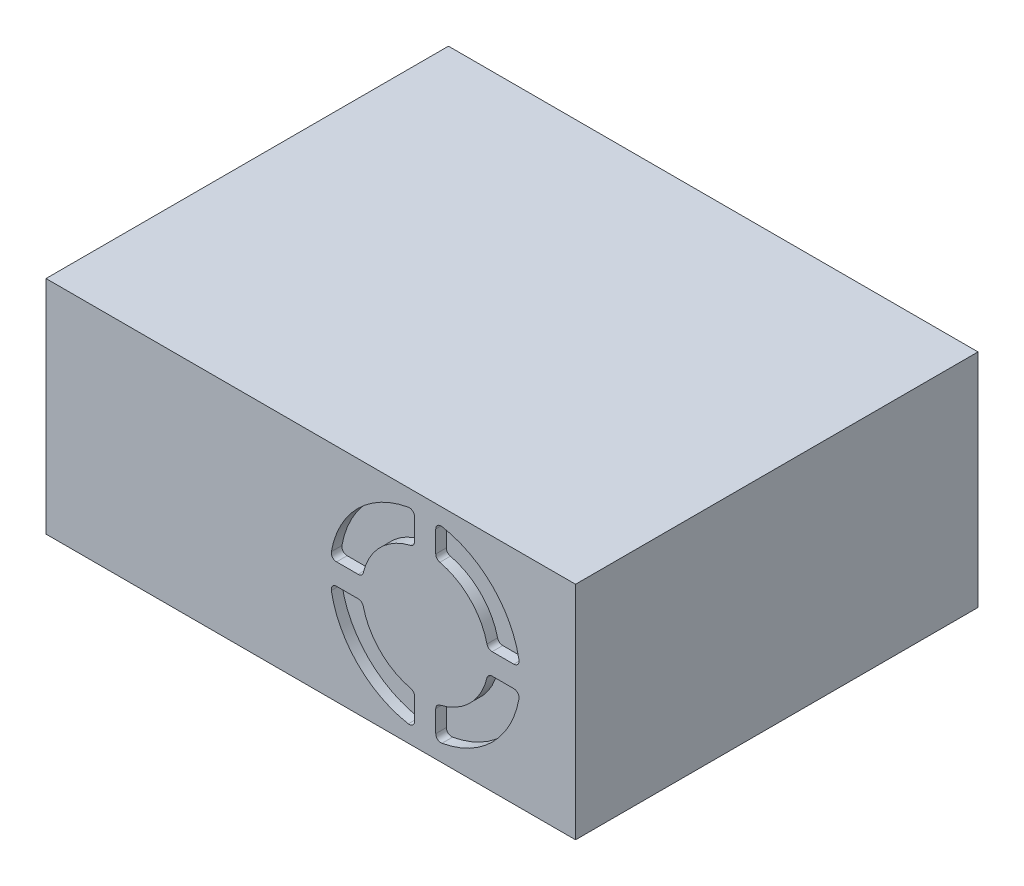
from build123d import *

# Parameters (mm, degrees)
SKETCH1_W           = 50
SKETCH1_H           = 38
BOSS_EXTRUDE1_DEPTH = 20.9
CUT_EXTRUDE1_DEPTH  = 1


with BuildPart() as part:
    # Sketch1 → Boss-Extrude1 (new body)
    with BuildSketch(Plane(origin=(0, 0, 0), x_dir=(1, 0, 0), z_dir=(0, 1, 0))):
        with Locations((25, 19)):
            Rectangle(SKETCH1_W, SKETCH1_H)
    extrude(amount=BOSS_EXTRUDE1_DEPTH)

    # Sketch2 → Cut-Extrude1 (cut)
    with BuildSketch(Plane.XY):
        with BuildLine():
            Line((42.12455532, 11.45), (44.166600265, 11.45))
            ThreePointArc((44.166600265, 11.45), (44.55008276, 11.629155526), (44.658753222, 12.038235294))
            ThreePointArc((44.658753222, 12.038235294), (42.163961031, 16.813961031), (37.388235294, 19.308753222))
            ThreePointArc((37.388235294, 19.308753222), (36.979155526, 19.20008276), (36.8, 18.816600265))
            Line((36.8, 18.816600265), (36.8, 16.77455532))
            ThreePointArc((36.8, 16.77455532), (36.90776773, 16.464468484), (37.184615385, 16.288051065))
            ThreePointArc((37.184615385, 16.288051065), (40.042640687, 14.692640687), (41.638051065, 11.834615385))
            ThreePointArc((41.638051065, 11.834615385), (41.814468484, 11.55776773), (42.12455532, 11.45))
        make_face()
        with BuildLine():
            Line((34.8, 18.816600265), (34.8, 16.77455532))
            ThreePointArc((34.8, 16.77455532), (34.69223227, 16.464468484), (34.415384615, 16.288051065))
            ThreePointArc((34.415384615, 16.288051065), (31.557359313, 14.692640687), (29.961948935, 11.834615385))
            ThreePointArc((29.961948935, 11.834615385), (29.785531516, 11.55776773), (29.47544468, 11.45))
            Line((29.47544468, 11.45), (27.433399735, 11.45))
            ThreePointArc((27.433399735, 11.45), (27.04991724, 11.629155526), (26.941246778, 12.038235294))
            ThreePointArc((26.941246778, 12.038235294), (29.436038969, 16.813961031), (34.211764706, 19.308753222))
            ThreePointArc((34.211764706, 19.308753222), (34.620844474, 19.20008276), (34.8, 18.816600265))
        make_face()
        with BuildLine():
            Line((27.433399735, 9.45), (29.47544468, 9.45))
            ThreePointArc((29.47544468, 9.45), (29.785531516, 9.34223227), (29.961948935, 9.065384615))
            ThreePointArc((29.961948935, 9.065384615), (31.557359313, 6.207359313), (34.415384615, 4.611948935))
            ThreePointArc((34.415384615, 4.611948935), (34.69223227, 4.435531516), (34.8, 4.12544468))
            Line((34.8, 4.12544468), (34.8, 2.083399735))
            ThreePointArc((34.8, 2.083399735), (34.620844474, 1.69991724), (34.211764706, 1.591246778))
            ThreePointArc((34.211764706, 1.591246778), (29.436038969, 4.086038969), (26.941246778, 8.861764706))
            ThreePointArc((26.941246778, 8.861764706), (27.04991724, 9.270844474), (27.433399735, 9.45))
        make_face()
        with BuildLine():
            Line((42.12455532, 9.45), (44.166600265, 9.45))
            ThreePointArc((44.166600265, 9.45), (44.55008276, 9.270844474), (44.658753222, 8.861764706))
            ThreePointArc((44.658753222, 8.861764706), (42.163961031, 4.086038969), (37.388235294, 1.591246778))
            ThreePointArc((37.388235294, 1.591246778), (36.979155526, 1.69991724), (36.8, 2.083399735))
            Line((36.8, 2.083399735), (36.8, 4.12544468))
            ThreePointArc((36.8, 4.12544468), (36.90776773, 4.435531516), (37.184615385, 4.611948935))
            ThreePointArc((37.184615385, 4.611948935), (40.042640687, 6.207359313), (41.638051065, 9.065384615))
            ThreePointArc((41.638051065, 9.065384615), (41.814468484, 9.34223227), (42.12455532, 9.45))
        make_face()
    extrude(amount=-CUT_EXTRUDE1_DEPTH, mode=Mode.SUBTRACT)


solid = part.part
